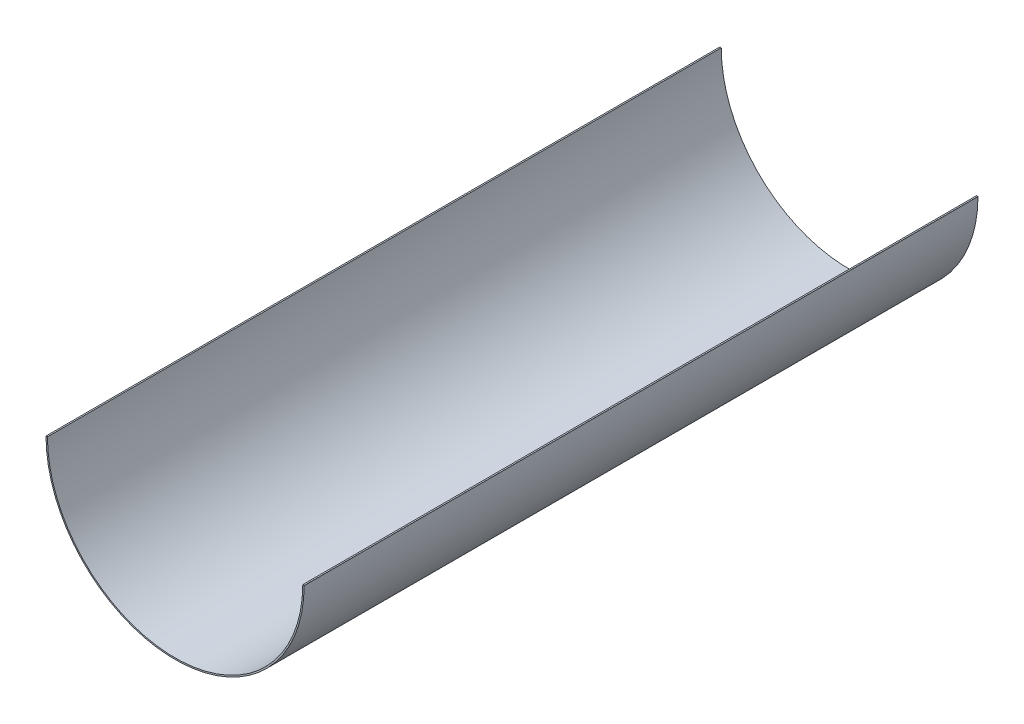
ISO-10303-21;
HEADER;
FILE_DESCRIPTION(('STEP AP214'),'2;1');
FILE_NAME('part.step','',(''),(''),'','','');
FILE_SCHEMA(('AUTOMOTIVE_DESIGN { 1 0 10303 214 1 1 1 1 }'));
ENDSEC;
DATA;
#1=APPLICATION_CONTEXT('core data for automotive mechanical design processes');
#2=APPLICATION_PROTOCOL_DEFINITION('international standard','automotive_design',2000,#1);
#3=PRODUCT_CONTEXT('',#1,'mechanical');
#4=PRODUCT('Part','Part','',(#3));
#5=PRODUCT_RELATED_PRODUCT_CATEGORY('part','',(#4));
#6=PRODUCT_DEFINITION_FORMATION('','',#4);
#7=PRODUCT_DEFINITION_CONTEXT('part definition',#1,'design');
#8=PRODUCT_DEFINITION('design','',#6,#7);
#9=PRODUCT_DEFINITION_SHAPE('','',#8);
#10=(LENGTH_UNIT() NAMED_UNIT(*) SI_UNIT(.MILLI.,.METRE.));
#11=(NAMED_UNIT(*) PLANE_ANGLE_UNIT() SI_UNIT($,.RADIAN.));
#12=(NAMED_UNIT(*) SI_UNIT($,.STERADIAN.) SOLID_ANGLE_UNIT());
#13=UNCERTAINTY_MEASURE_WITH_UNIT(LENGTH_MEASURE(1.E-05),#10,'distance_accuracy_value','');
#14=(GEOMETRIC_REPRESENTATION_CONTEXT(3) GLOBAL_UNCERTAINTY_ASSIGNED_CONTEXT((#13)) GLOBAL_UNIT_ASSIGNED_CONTEXT((#10,
#11,#12)) REPRESENTATION_CONTEXT('',''));
#15=CARTESIAN_POINT('',(0.,0.,0.));
#16=DIRECTION('',(0.,0.,1.));
#17=DIRECTION('',(1.,0.,0.));
#18=AXIS2_PLACEMENT_3D('',#15,#16,#17);
#19=CARTESIAN_POINT('',(179.997222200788,-0.997218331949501,950.));
#20=DIRECTION('',(0.,0.,1.));
#21=DIRECTION('',(1.,0.,0.));
#22=AXIS2_PLACEMENT_3D('',#19,#20,#21);
#23=PLANE('',#22);
#24=DIRECTION('',(1.,0.,0.));
#25=VECTOR('',#24,1.);
#26=CARTESIAN_POINT('',(179.997222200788,-0.997218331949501,950.));
#27=LINE('',#26,#25);
#28=CARTESIAN_POINT('',(179.997222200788,-0.997218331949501,950.));
#29=VERTEX_POINT('',#28);
#30=CARTESIAN_POINT('',(181.997222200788,-0.99721833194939,950.));
#31=VERTEX_POINT('',#30);
#32=EDGE_CURVE('E11',#29,#31,#27,.T.);
#33=ORIENTED_EDGE('',*,*,#32,.F.);
#34=CARTESIAN_POINT('',(178.997222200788,-0.997218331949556,950.));
#35=DIRECTION('',(0.,0.,1.));
#36=DIRECTION('',(1.,0.,0.));
#37=AXIS2_PLACEMENT_3D('',#34,#35,#36);
#38=CIRCLE('',#37,1.);
#39=CARTESIAN_POINT('',(179.997206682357,-1.00278938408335,950.));
#40=VERTEX_POINT('',#39);
#41=EDGE_CURVE('E135',#40,#29,#38,.T.);
#42=ORIENTED_EDGE('',*,*,#41,.F.);
#43=DIRECTION('',(-0.99998448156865,0.0055710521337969,0.));
#44=VECTOR('',#43,1.);
#45=CARTESIAN_POINT('',(181.997175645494,-1.01393148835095,950.));
#46=LINE('',#45,#44);
#47=CARTESIAN_POINT('',(181.997175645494,-1.01393148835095,950.));
#48=VERTEX_POINT('',#47);
#49=EDGE_CURVE('E46',#48,#40,#46,.T.);
#50=ORIENTED_EDGE('',*,*,#49,.F.);
#51=CARTESIAN_POINT('',(178.997222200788,-0.997218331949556,950.));
#52=DIRECTION('',(0.,0.,1.));
#53=DIRECTION('',(1.,0.,0.));
#54=AXIS2_PLACEMENT_3D('',#51,#52,#53);
#55=CIRCLE('',#54,3.);
#56=EDGE_CURVE('E128',#48,#31,#55,.T.);
#57=ORIENTED_EDGE('',*,*,#56,.T.);
#58=EDGE_LOOP('',(#33,#42,#50,#57));
#59=FACE_BOUND('',#58,.T.);
#60=ADVANCED_FACE('F38',(#59),#23,.T.);
#61=CARTESIAN_POINT('',(181.997175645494,-1.01393148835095,950.));
#62=DIRECTION('',(0.,0.,1.));
#63=DIRECTION('',(1.,0.,0.));
#64=AXIS2_PLACEMENT_3D('',#61,#62,#63);
#65=PLANE('',#64);
#66=DIRECTION('',(0.,1.,0.));
#67=VECTOR('',#66,1.);
#68=CARTESIAN_POINT('',(179.997222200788,-1.,950.));
#69=LINE('',#68,#67);
#70=CARTESIAN_POINT('',(179.997222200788,-0.5,950.));
#71=VERTEX_POINT('',#70);
#72=EDGE_CURVE('E184',#29,#71,#69,.T.);
#73=ORIENTED_EDGE('',*,*,#72,.F.);
#74=ORIENTED_EDGE('',*,*,#32,.T.);
#75=DIRECTION('',(0.,1.,0.));
#76=VECTOR('',#75,1.);
#77=CARTESIAN_POINT('',(181.997222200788,-0.999999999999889,950.));
#78=LINE('',#77,#76);
#79=CARTESIAN_POINT('',(181.997222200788,-0.499999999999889,950.));
#80=VERTEX_POINT('',#79);
#81=EDGE_CURVE('E94',#31,#80,#78,.T.);
#82=ORIENTED_EDGE('',*,*,#81,.T.);
#83=DIRECTION('',(1.,0.,0.));
#84=VECTOR('',#83,1.);
#85=CARTESIAN_POINT('',(179.997222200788,-0.5,950.));
#86=LINE('',#85,#84);
#87=EDGE_CURVE('E341',#71,#80,#86,.T.);
#88=ORIENTED_EDGE('',*,*,#87,.F.);
#89=EDGE_LOOP('',(#73,#74,#82,#88));
#90=FACE_BOUND('',#89,.T.);
#91=ADVANCED_FACE('F192',(#90),#65,.T.);
#92=CARTESIAN_POINT('',(179.997206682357,-1.00278938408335,0.));
#93=DIRECTION('',(0.,0.,-1.));
#94=DIRECTION('',(-1.,0.,0.));
#95=AXIS2_PLACEMENT_3D('',#92,#93,#94);
#96=PLANE('',#95);
#97=DIRECTION('',(0.99998448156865,-0.0055710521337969,0.));
#98=VECTOR('',#97,1.);
#99=CARTESIAN_POINT('',(179.997206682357,-1.00278938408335,0.));
#100=LINE('',#99,#98);
#101=CARTESIAN_POINT('',(179.997206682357,-1.00278938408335,0.));
#102=VERTEX_POINT('',#101);
#103=CARTESIAN_POINT('',(181.997175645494,-1.01393148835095,0.));
#104=VERTEX_POINT('',#103);
#105=EDGE_CURVE('E81',#102,#104,#100,.T.);
#106=ORIENTED_EDGE('',*,*,#105,.F.);
#107=CARTESIAN_POINT('',(178.997222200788,-0.997218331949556,0.));
#108=DIRECTION('',(0.,0.,1.));
#109=DIRECTION('',(1.,0.,0.));
#110=AXIS2_PLACEMENT_3D('',#107,#108,#109);
#111=CIRCLE('',#110,1.);
#112=CARTESIAN_POINT('',(179.997222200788,-0.997218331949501,0.));
#113=VERTEX_POINT('',#112);
#114=EDGE_CURVE('E150',#102,#113,#111,.T.);
#115=ORIENTED_EDGE('',*,*,#114,.T.);
#116=DIRECTION('',(-1.,0.,0.));
#117=VECTOR('',#116,1.);
#118=CARTESIAN_POINT('',(181.997222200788,-0.99721833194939,0.));
#119=LINE('',#118,#117);
#120=CARTESIAN_POINT('',(181.997222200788,-0.99721833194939,0.));
#121=VERTEX_POINT('',#120);
#122=EDGE_CURVE('E88',#121,#113,#119,.T.);
#123=ORIENTED_EDGE('',*,*,#122,.F.);
#124=CARTESIAN_POINT('',(178.997222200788,-0.997218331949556,0.));
#125=DIRECTION('',(0.,0.,1.));
#126=DIRECTION('',(1.,0.,0.));
#127=AXIS2_PLACEMENT_3D('',#124,#125,#126);
#128=CIRCLE('',#127,3.);
#129=EDGE_CURVE('E157',#104,#121,#128,.T.);
#130=ORIENTED_EDGE('',*,*,#129,.F.);
#131=EDGE_LOOP('',(#106,#115,#123,#130));
#132=FACE_BOUND('',#131,.T.);
#133=ADVANCED_FACE('F190',(#132),#96,.T.);
#134=CARTESIAN_POINT('',(181.997222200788,-0.99721833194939,0.));
#135=DIRECTION('',(0.,0.,-1.));
#136=DIRECTION('',(-1.,0.,0.));
#137=AXIS2_PLACEMENT_3D('',#134,#135,#136);
#138=PLANE('',#137);
#139=CARTESIAN_POINT('',(0.,0.,0.));
#140=DIRECTION('',(0.,0.,1.));
#141=DIRECTION('',(1.,0.,0.));
#142=AXIS2_PLACEMENT_3D('',#139,#140,#141);
#143=CIRCLE('',#142,180.);
#144=CARTESIAN_POINT('',(-180.,0.,0.));
#145=VERTEX_POINT('',#144);
#146=EDGE_CURVE('E152',#145,#102,#143,.T.);
#147=ORIENTED_EDGE('',*,*,#146,.T.);
#148=ORIENTED_EDGE('',*,*,#105,.T.);
#149=CARTESIAN_POINT('',(0.,0.,0.));
#150=DIRECTION('',(0.,0.,1.));
#151=DIRECTION('',(1.,0.,0.));
#152=AXIS2_PLACEMENT_3D('',#149,#150,#151);
#153=CIRCLE('',#152,182.);
#154=CARTESIAN_POINT('',(-182.,0.,0.));
#155=VERTEX_POINT('',#154);
#156=EDGE_CURVE('E155',#155,#104,#153,.T.);
#157=ORIENTED_EDGE('',*,*,#156,.F.);
#158=DIRECTION('',(1.,0.,0.));
#159=VECTOR('',#158,1.);
#160=CARTESIAN_POINT('',(-182.,0.,0.));
#161=LINE('',#160,#159);
#162=EDGE_CURVE('E116',#155,#145,#161,.T.);
#163=ORIENTED_EDGE('',*,*,#162,.T.);
#164=EDGE_LOOP('',(#147,#148,#157,#163));
#165=FACE_BOUND('',#164,.T.);
#166=ADVANCED_FACE('F186',(#165),#138,.T.);
#167=CARTESIAN_POINT('',(181.997222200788,-0.999999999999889,950.));
#168=DIRECTION('',(-1.,0.,0.));
#169=DIRECTION('',(0.,-1.,0.));
#170=AXIS2_PLACEMENT_3D('',#167,#168,#169);
#171=PLANE('',#170);
#172=DIRECTION('',(0.,1.,0.));
#173=VECTOR('',#172,1.);
#174=CARTESIAN_POINT('',(181.997222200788,-0.999999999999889,0.));
#175=LINE('',#174,#173);
#176=CARTESIAN_POINT('',(181.997222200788,-0.499999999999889,0.));
#177=VERTEX_POINT('',#176);
#178=EDGE_CURVE('E141',#121,#177,#175,.T.);
#179=ORIENTED_EDGE('',*,*,#178,.T.);
#180=DIRECTION('',(0.,0.,-1.));
#181=VECTOR('',#180,1.);
#182=CARTESIAN_POINT('',(181.997222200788,-0.499999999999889,950.));
#183=LINE('',#182,#181);
#184=EDGE_CURVE('E171',#80,#177,#183,.T.);
#185=ORIENTED_EDGE('',*,*,#184,.F.);
#186=ORIENTED_EDGE('',*,*,#81,.F.);
#187=DIRECTION('',(0.,0.,-1.));
#188=VECTOR('',#187,1.);
#189=CARTESIAN_POINT('',(181.997222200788,-0.99721833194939,950.));
#190=LINE('',#189,#188);
#191=EDGE_CURVE('E140',#31,#121,#190,.T.);
#192=ORIENTED_EDGE('',*,*,#191,.T.);
#193=EDGE_LOOP('',(#179,#185,#186,#192));
#194=FACE_BOUND('',#193,.T.);
#195=ADVANCED_FACE('F198',(#194),#171,.F.);
#196=CARTESIAN_POINT('',(179.997222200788,-0.5,950.));
#197=DIRECTION('',(0.,1.,0.));
#198=DIRECTION('',(-1.,0.,0.));
#199=AXIS2_PLACEMENT_3D('',#196,#197,#198);
#200=PLANE('',#199);
#201=DIRECTION('',(1.,0.,0.));
#202=VECTOR('',#201,1.);
#203=CARTESIAN_POINT('',(179.997222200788,-0.5,0.));
#204=LINE('',#203,#202);
#205=CARTESIAN_POINT('',(179.997222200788,-0.5,0.));
#206=VERTEX_POINT('',#205);
#207=EDGE_CURVE('E144',#206,#177,#204,.T.);
#208=ORIENTED_EDGE('',*,*,#207,.F.);
#209=DIRECTION('',(0.,0.,-1.));
#210=VECTOR('',#209,1.);
#211=CARTESIAN_POINT('',(179.997222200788,-0.5,950.));
#212=LINE('',#211,#210);
#213=EDGE_CURVE('E169',#71,#206,#212,.T.);
#214=ORIENTED_EDGE('',*,*,#213,.F.);
#215=ORIENTED_EDGE('',*,*,#87,.T.);
#216=ORIENTED_EDGE('',*,*,#184,.T.);
#217=EDGE_LOOP('',(#208,#214,#215,#216));
#218=FACE_BOUND('',#217,.T.);
#219=ADVANCED_FACE('F229',(#218),#200,.T.);
#220=CARTESIAN_POINT('',(179.997222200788,-1.,950.));
#221=DIRECTION('',(-1.,0.,0.));
#222=DIRECTION('',(0.,-1.,0.));
#223=AXIS2_PLACEMENT_3D('',#220,#221,#222);
#224=PLANE('',#223);
#225=DIRECTION('',(0.,1.,0.));
#226=VECTOR('',#225,1.);
#227=CARTESIAN_POINT('',(179.997222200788,-1.,0.));
#228=LINE('',#227,#226);
#229=EDGE_CURVE('E147',#113,#206,#228,.T.);
#230=ORIENTED_EDGE('',*,*,#229,.F.);
#231=DIRECTION('',(0.,0.,-1.));
#232=VECTOR('',#231,1.);
#233=CARTESIAN_POINT('',(179.997222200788,-0.997218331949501,950.));
#234=LINE('',#233,#232);
#235=EDGE_CURVE('E166',#29,#113,#234,.T.);
#236=ORIENTED_EDGE('',*,*,#235,.F.);
#237=ORIENTED_EDGE('',*,*,#72,.T.);
#238=ORIENTED_EDGE('',*,*,#213,.T.);
#239=EDGE_LOOP('',(#230,#236,#237,#238));
#240=FACE_BOUND('',#239,.T.);
#241=ADVANCED_FACE('F240',(#240),#224,.T.);
#242=CARTESIAN_POINT('',(178.997222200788,-0.997218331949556,950.));
#243=DIRECTION('',(0.,0.,-1.));
#244=DIRECTION('',(-1.,0.,0.));
#245=AXIS2_PLACEMENT_3D('',#242,#243,#244);
#246=CYLINDRICAL_SURFACE('',#245,1.);
#247=ORIENTED_EDGE('',*,*,#114,.F.);
#248=DIRECTION('',(0.,0.,-1.));
#249=VECTOR('',#248,1.);
#250=CARTESIAN_POINT('',(179.997206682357,-1.00278938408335,950.));
#251=LINE('',#250,#249);
#252=EDGE_CURVE('E163',#40,#102,#251,.T.);
#253=ORIENTED_EDGE('',*,*,#252,.F.);
#254=ORIENTED_EDGE('',*,*,#41,.T.);
#255=ORIENTED_EDGE('',*,*,#235,.T.);
#256=EDGE_LOOP('',(#247,#253,#254,#255));
#257=FACE_BOUND('',#256,.T.);
#258=ADVANCED_FACE('F180',(#257),#246,.F.);
#259=CARTESIAN_POINT('',(0.,0.,950.));
#260=DIRECTION('',(0.,0.,-1.));
#261=DIRECTION('',(-1.,0.,0.));
#262=AXIS2_PLACEMENT_3D('',#259,#260,#261);
#263=CYLINDRICAL_SURFACE('',#262,180.);
#264=ORIENTED_EDGE('',*,*,#146,.F.);
#265=DIRECTION('',(0.,0.,-1.));
#266=VECTOR('',#265,1.);
#267=CARTESIAN_POINT('',(-180.,0.,950.));
#268=LINE('',#267,#266);
#269=CARTESIAN_POINT('',(-180.,0.,950.));
#270=VERTEX_POINT('',#269);
#271=EDGE_CURVE('E118',#270,#145,#268,.T.);
#272=ORIENTED_EDGE('',*,*,#271,.F.);
#273=CARTESIAN_POINT('',(0.,0.,950.));
#274=DIRECTION('',(0.,0.,1.));
#275=DIRECTION('',(1.,0.,0.));
#276=AXIS2_PLACEMENT_3D('',#273,#274,#275);
#277=CIRCLE('',#276,180.);
#278=EDGE_CURVE('E133',#270,#40,#277,.T.);
#279=ORIENTED_EDGE('',*,*,#278,.T.);
#280=ORIENTED_EDGE('',*,*,#252,.T.);
#281=EDGE_LOOP('',(#264,#272,#279,#280));
#282=FACE_BOUND('',#281,.T.);
#283=ADVANCED_FACE('F185',(#282),#263,.F.);
#284=CARTESIAN_POINT('',(-182.,0.,950.));
#285=DIRECTION('',(0.,1.,0.));
#286=DIRECTION('',(-1.,0.,0.));
#287=AXIS2_PLACEMENT_3D('',#284,#285,#286);
#288=PLANE('',#287);
#289=ORIENTED_EDGE('',*,*,#162,.F.);
#290=DIRECTION('',(0.,0.,-1.));
#291=VECTOR('',#290,1.);
#292=CARTESIAN_POINT('',(-182.,0.,950.));
#293=LINE('',#292,#291);
#294=CARTESIAN_POINT('',(-182.,0.,950.));
#295=VERTEX_POINT('',#294);
#296=EDGE_CURVE('E110',#295,#155,#293,.T.);
#297=ORIENTED_EDGE('',*,*,#296,.F.);
#298=DIRECTION('',(1.,0.,0.));
#299=VECTOR('',#298,1.);
#300=CARTESIAN_POINT('',(-182.,0.,950.));
#301=LINE('',#300,#299);
#302=EDGE_CURVE('E114',#295,#270,#301,.T.);
#303=ORIENTED_EDGE('',*,*,#302,.T.);
#304=ORIENTED_EDGE('',*,*,#271,.T.);
#305=EDGE_LOOP('',(#289,#297,#303,#304));
#306=FACE_BOUND('',#305,.T.);
#307=ADVANCED_FACE('F112',(#306),#288,.T.);
#308=CARTESIAN_POINT('',(0.,0.,950.));
#309=DIRECTION('',(0.,0.,-1.));
#310=DIRECTION('',(-1.,0.,0.));
#311=AXIS2_PLACEMENT_3D('',#308,#309,#310);
#312=CYLINDRICAL_SURFACE('',#311,182.);
#313=ORIENTED_EDGE('',*,*,#156,.T.);
#314=DIRECTION('',(0.,0.,-1.));
#315=VECTOR('',#314,1.);
#316=CARTESIAN_POINT('',(181.997175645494,-1.01393148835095,950.));
#317=LINE('',#316,#315);
#318=EDGE_CURVE('E119',#48,#104,#317,.T.);
#319=ORIENTED_EDGE('',*,*,#318,.F.);
#320=CARTESIAN_POINT('',(0.,0.,950.));
#321=DIRECTION('',(0.,0.,1.));
#322=DIRECTION('',(1.,0.,0.));
#323=AXIS2_PLACEMENT_3D('',#320,#321,#322);
#324=CIRCLE('',#323,182.);
#325=EDGE_CURVE('E123',#295,#48,#324,.T.);
#326=ORIENTED_EDGE('',*,*,#325,.F.);
#327=ORIENTED_EDGE('',*,*,#296,.T.);
#328=EDGE_LOOP('',(#313,#319,#326,#327));
#329=FACE_BOUND('',#328,.T.);
#330=ADVANCED_FACE('F124',(#329),#312,.T.);
#331=CARTESIAN_POINT('',(178.997222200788,-0.997218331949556,950.));
#332=DIRECTION('',(0.,0.,-1.));
#333=DIRECTION('',(-1.,0.,0.));
#334=AXIS2_PLACEMENT_3D('',#331,#332,#333);
#335=CYLINDRICAL_SURFACE('',#334,3.);
#336=ORIENTED_EDGE('',*,*,#129,.T.);
#337=ORIENTED_EDGE('',*,*,#191,.F.);
#338=ORIENTED_EDGE('',*,*,#56,.F.);
#339=ORIENTED_EDGE('',*,*,#318,.T.);
#340=EDGE_LOOP('',(#336,#337,#338,#339));
#341=FACE_BOUND('',#340,.T.);
#342=ADVANCED_FACE('F188',(#341),#335,.T.);
#343=CARTESIAN_POINT('',(178.997222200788,-0.997218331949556,950.));
#344=DIRECTION('',(0.,0.,1.));
#345=DIRECTION('',(1.,0.,0.));
#346=AXIS2_PLACEMENT_3D('',#343,#344,#345);
#347=PLANE('',#346);
#348=ORIENTED_EDGE('',*,*,#325,.T.);
#349=ORIENTED_EDGE('',*,*,#49,.T.);
#350=ORIENTED_EDGE('',*,*,#278,.F.);
#351=ORIENTED_EDGE('',*,*,#302,.F.);
#352=EDGE_LOOP('',(#348,#349,#350,#351));
#353=FACE_BOUND('',#352,.T.);
#354=ADVANCED_FACE('F131',(#353),#347,.T.);
#355=CARTESIAN_POINT('',(178.997222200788,-0.997218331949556,0.));
#356=DIRECTION('',(0.,0.,1.));
#357=DIRECTION('',(1.,0.,0.));
#358=AXIS2_PLACEMENT_3D('',#355,#356,#357);
#359=PLANE('',#358);
#360=ORIENTED_EDGE('',*,*,#178,.F.);
#361=ORIENTED_EDGE('',*,*,#122,.T.);
#362=ORIENTED_EDGE('',*,*,#229,.T.);
#363=ORIENTED_EDGE('',*,*,#207,.T.);
#364=EDGE_LOOP('',(#360,#361,#362,#363));
#365=FACE_BOUND('',#364,.T.);
#366=ADVANCED_FACE('F306',(#365),#359,.F.);
#367=CLOSED_SHELL('',(#60,#91,#133,#166,#195,#219,#241,#258,#283,#307,#330,#342,#354,#366));
#368=MANIFOLD_SOLID_BREP('B2',#367);
#369=ADVANCED_BREP_SHAPE_REPRESENTATION('',(#18,#368),#14);
#370=SHAPE_DEFINITION_REPRESENTATION(#9,#369);
ENDSEC;
END-ISO-10303-21;
